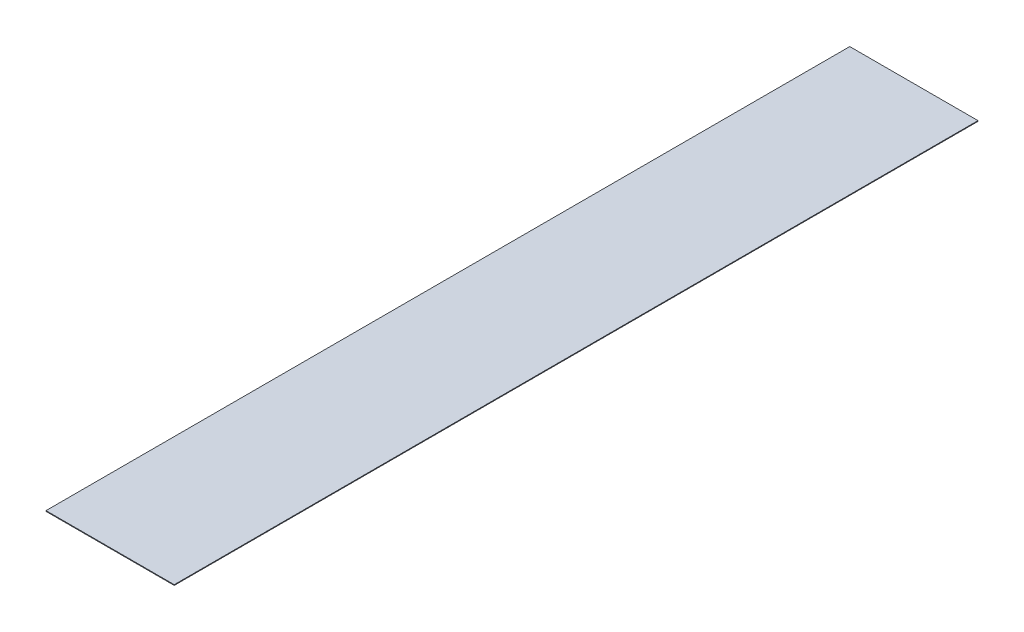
from build123d import *

# Parameters (mm, degrees)
SKETCH1_W           = 47.625
SKETCH1_H           = 298.45
BOSS_EXTRUDE1_DEPTH = 0.254


with BuildPart() as part:
    # Sketch1 → Boss-Extrude1 (new body)
    with BuildSketch(Plane(origin=(0, 0, 0), x_dir=(1, 0, 0), z_dir=(0, 1, 0))):
        with Locations((-23.8125, -149.225)):
            Rectangle(SKETCH1_W, SKETCH1_H)
    extrude(amount=BOSS_EXTRUDE1_DEPTH)


solid = part.part
